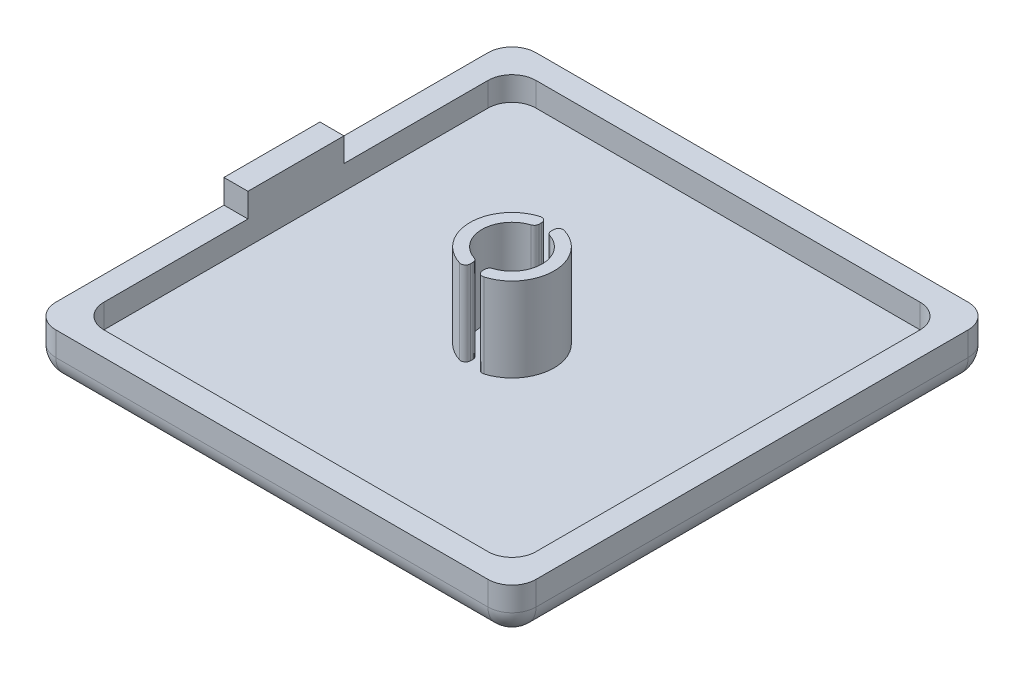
from build123d import *

# Parameters (mm, degrees)
SKETCH_1_W      = 40
SKETCH_1_H      = 40
SKETCH_1_W_2    = 36
SKETCH_1_H_2    = 35.998818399
EXTRUDE_1_DEPTH = 4
SKETCH_1_2_W    = 36
SKETCH_1_2_H    = 35.998818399
EXTRUDE_2_DEPTH = 2
FILLET_1_R      = 2
FILLET_2_R      = 2
EXTRUDE_4_DEPTH = 7
SKETCH_4_W      = 8
SKETCH_4_H      = 2
EXTRUDE_5_DEPTH = 2


with BuildPart() as part:
    # Sketch 1 → Extrude 1 (new body)
    with BuildSketch(Plane(origin=(0, 0, 0), x_dir=(1, 0, 0), z_dir=(0, 1, 0))):
        with Locations((20, 20)):
            Rectangle(SKETCH_1_W, SKETCH_1_H)
        with Locations((20, 19.9994092)):
            Rectangle(SKETCH_1_W_2, SKETCH_1_H_2, mode=Mode.SUBTRACT)
    extrude(amount=EXTRUDE_1_DEPTH)

    # Sketch 1_2 → Extrude 2 (add)
    with BuildSketch(Plane(origin=(0, 0, 0), x_dir=(1, 0, 0), z_dir=(0, 1, 0))):
        with Locations((20, 19.9994092)):
            Rectangle(SKETCH_1_2_W, SKETCH_1_2_H)
    extrude(amount=EXTRUDE_2_DEPTH)

    # Fillet 1
    fillet_1_edges = [part.edges().sort_by_distance(p)[0] for p in [
        (2, 3, -37.998818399),
        (2, 3, -2),
        (38, 3, -2),
        (38, 3, -37.998818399),
        (0, 2, -40),
        (40, 2, -40),
        (40, 2, 0),
        (0, 2, 0),
    ]]
    fillet(fillet_1_edges, radius=FILLET_1_R)

    # Fillet 2
    fillet_2_edges = [part.edges().sort_by_distance(p)[0] for p in [
        (0, 0, -20),
        (20, 0, -40),
        (40, 0, -20),
        (20, 0, 0),
        (39.414213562, 0, -0.585786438),
        (0.585786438, 0, -0.585786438),
        (39.414213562, 0, -39.414213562),
        (0.585786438, 0, -39.414213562),
    ]]
    fillet(fillet_2_edges, radius=FILLET_2_R)

    # Sketch 3 → Extrude 4 (add)
    with BuildSketch(Plane(origin=(0, 2, 0), x_dir=(1, 0, 0), z_dir=(0, 1, 0))):
        with BuildLine():
            Line((20.5, 17.242599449), (20.5, 17.032929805))
            ThreePointArc((20.5, 17.032929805), (20.661726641, 16.711642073), (21.016129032, 16.65015827))
            ThreePointArc((21.016129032, 16.65015827), (23.5, 19.9994092), (21.016129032, 23.348660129))
            ThreePointArc((21.016129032, 23.348660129), (20.661726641, 23.287176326), (20.5, 22.965888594))
            Line((20.5, 22.965888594), (20.5, 22.75621895))
            ThreePointArc((20.5, 22.75621895), (20.576229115, 22.521330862), (20.775862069, 22.375969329))
            ThreePointArc((20.775862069, 22.375969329), (22.5, 19.9994092), (20.775862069, 17.62284907))
            ThreePointArc((20.775862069, 17.62284907), (20.576229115, 17.477487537), (20.5, 17.242599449))
        make_face()
        with BuildLine():
            Line((19.5, 17.242599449), (19.5, 17.032929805))
            ThreePointArc((19.5, 17.032929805), (19.338273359, 16.711642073), (18.983870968, 16.65015827))
            ThreePointArc((18.983870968, 16.65015827), (16.5, 19.9994092), (18.983870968, 23.348660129))
            ThreePointArc((18.983870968, 23.348660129), (19.338273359, 23.287176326), (19.5, 22.965888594))
            Line((19.5, 22.965888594), (19.5, 22.75621895))
            ThreePointArc((19.5, 22.75621895), (19.423770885, 22.521330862), (19.224137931, 22.375969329))
            ThreePointArc((19.224137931, 22.375969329), (17.5, 19.9994092), (19.224137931, 17.62284907))
            ThreePointArc((19.224137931, 17.62284907), (19.423770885, 17.477487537), (19.5, 17.242599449))
        make_face()
    extrude(amount=EXTRUDE_4_DEPTH)

    # Sketch 4 → Extrude 5 (add)
    with BuildSketch(Plane.ZY):
        with Locations((-20, 5)):
            Rectangle(SKETCH_4_W, SKETCH_4_H)
    extrude(amount=-EXTRUDE_5_DEPTH)


solid = part.part
